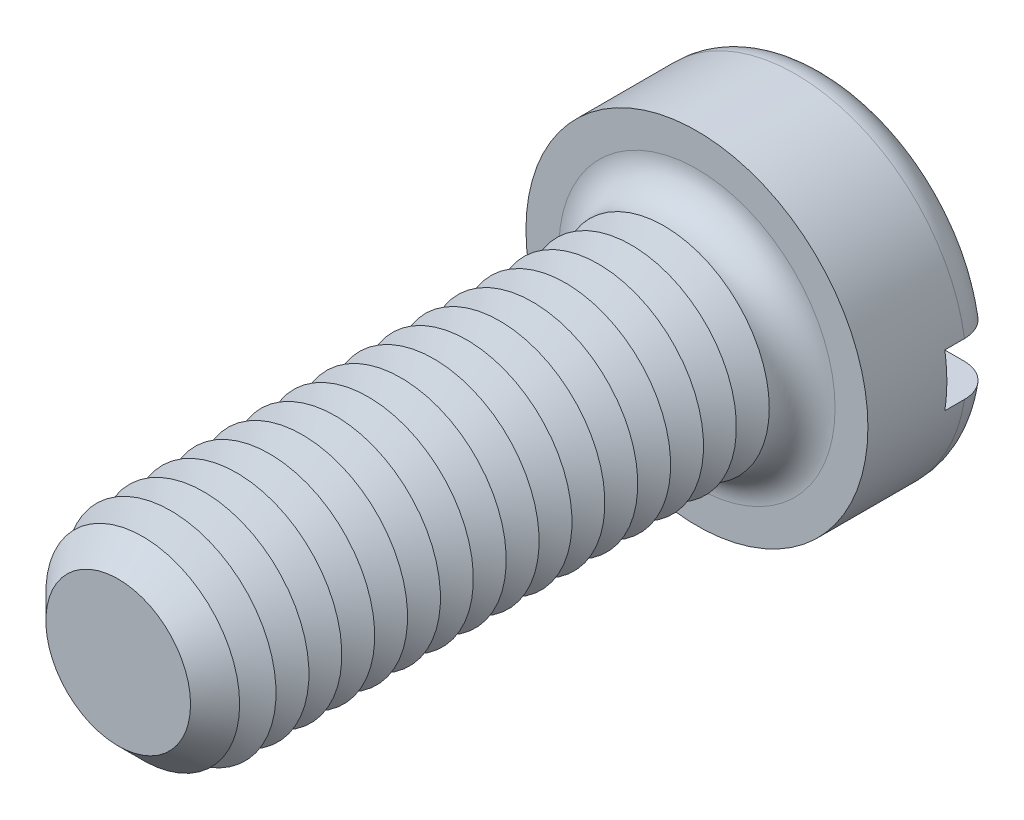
from build123d import *

# Parameters (mm, degrees)
SKETCH3_R           = 6.5
BOSS_EXTRUDE2_DEPTH = 5
SKETCH4_R           = 4
BOSS_EXTRUDE3_DEPTH = 22
FILLET1_R           = 1.25
CHAMFER1_SIZE       = 1.25
LPATTERN1_COUNT     = 16
LPATTERN1_PITCH     = 1.25
SKETCH8_W           = 13
SKETCH8_H           = 2
CUT_EXTRUDE1_DEPTH  = 2


with BuildPart() as part:
    # Sketch3 → Boss-Extrude2 (new body)
    with BuildSketch(Plane.XY):
        Circle(SKETCH3_R)
    extrude(amount=-BOSS_EXTRUDE2_DEPTH)

    # Sketch4 → Boss-Extrude3 (add)
    with BuildSketch(Plane.XY):
        Circle(SKETCH4_R)
    extrude(amount=BOSS_EXTRUDE3_DEPTH)

    # Fillet1
    fillet1_edges = [part.edges().sort_by_distance(p)[0] for p in [
        (-6.5, 0, -5),
        (-4, 0, 0),
    ]]
    fillet(fillet1_edges, radius=FILLET1_R)

    # Chamfer1
    chamfer1_edges = [part.edges().sort_by_distance(p)[0] for p in [
        (-4, 0, 22),
    ]]
    chamfer(chamfer1_edges, length=CHAMFER1_SIZE)

    # Sketch6 → Cut-Revolve1 (revolve, cut)
    with BuildSketch(Plane(origin=(0, 0, 0), x_dir=(0, 0, -1), z_dir=(1, 0, 0)), mode=Mode.PRIVATE) as cut_revolve1_sk:
        Polygon((-1.25, 4), (-1.875, 2.917468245), (-2.5, 4), align=None)
    cut_revolve1 = revolve(cut_revolve1_sk.sketch.rotate(Axis((0, 0, -1.694361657), (0, 0, 1)), 90), axis=Axis((0, 0, -1.694361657), (0, 0, 1)), mode=Mode.SUBTRACT)

    # LPattern1: Cut-Revolve1 ×16
    with Locations(*[(0, 0, i * LPATTERN1_PITCH) for i in range(1, LPATTERN1_COUNT)]):
        add(cut_revolve1, mode=Mode.SUBTRACT)

    # Sketch8 → Cut-Extrude1 (cut)
    with BuildSketch(Plane(origin=(0, 0, -5), x_dir=(-1, 0, 0), z_dir=(0, 0, -1))):
        Rectangle(SKETCH8_W, SKETCH8_H)
    extrude(amount=-CUT_EXTRUDE1_DEPTH, mode=Mode.SUBTRACT)


solid = part.part
